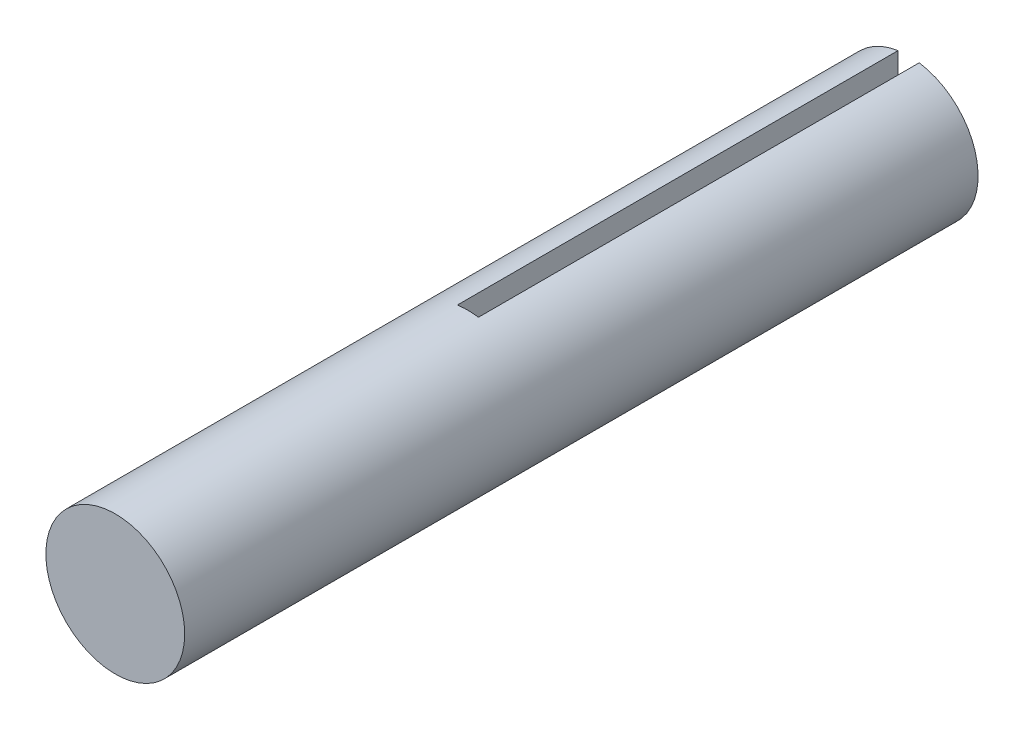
ISO-10303-21;
HEADER;
FILE_DESCRIPTION(('STEP AP214'),'2;1');
FILE_NAME('part.step','',(''),(''),'','','');
FILE_SCHEMA(('AUTOMOTIVE_DESIGN { 1 0 10303 214 1 1 1 1 }'));
ENDSEC;
DATA;
#1=APPLICATION_CONTEXT('core data for automotive mechanical design processes');
#2=APPLICATION_PROTOCOL_DEFINITION('international standard','automotive_design',2000,#1);
#3=PRODUCT_CONTEXT('',#1,'mechanical');
#4=PRODUCT('Part','Part','',(#3));
#5=PRODUCT_RELATED_PRODUCT_CATEGORY('part','',(#4));
#6=PRODUCT_DEFINITION_FORMATION('','',#4);
#7=PRODUCT_DEFINITION_CONTEXT('part definition',#1,'design');
#8=PRODUCT_DEFINITION('design','',#6,#7);
#9=PRODUCT_DEFINITION_SHAPE('','',#8);
#10=(LENGTH_UNIT() NAMED_UNIT(*) SI_UNIT(.MILLI.,.METRE.));
#11=(NAMED_UNIT(*) PLANE_ANGLE_UNIT() SI_UNIT($,.RADIAN.));
#12=(NAMED_UNIT(*) SI_UNIT($,.STERADIAN.) SOLID_ANGLE_UNIT());
#13=UNCERTAINTY_MEASURE_WITH_UNIT(LENGTH_MEASURE(1.E-05),#10,'distance_accuracy_value','');
#14=(GEOMETRIC_REPRESENTATION_CONTEXT(3) GLOBAL_UNCERTAINTY_ASSIGNED_CONTEXT((#13)) GLOBAL_UNIT_ASSIGNED_CONTEXT((#10,
#11,#12)) REPRESENTATION_CONTEXT('',''));
#15=CARTESIAN_POINT('',(0.,0.,0.));
#16=DIRECTION('',(0.,0.,1.));
#17=DIRECTION('',(1.,0.,0.));
#18=AXIS2_PLACEMENT_3D('',#15,#16,#17);
#19=CARTESIAN_POINT('',(0.,0.,0.));
#20=DIRECTION('',(0.,0.,1.));
#21=DIRECTION('',(1.,0.,0.));
#22=AXIS2_PLACEMENT_3D('',#19,#20,#21);
#23=PLANE('',#22);
#24=DIRECTION('',(0.,-1.,0.));
#25=VECTOR('',#24,1.);
#26=CARTESIAN_POINT('',(-0.2286,1.65217391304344,0.));
#27=LINE('',#26,#25);
#28=CARTESIAN_POINT('',(-0.2286,1.48247834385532,0.));
#29=VERTEX_POINT('',#28);
#30=CARTESIAN_POINT('',(-0.2286,0.970387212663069,0.));
#31=VERTEX_POINT('',#30);
#32=EDGE_CURVE('E92',#29,#31,#27,.T.);
#33=ORIENTED_EDGE('',*,*,#32,.T.);
#34=CARTESIAN_POINT('',(0.,0.,0.));
#35=DIRECTION('',(0.,0.,1.));
#36=DIRECTION('',(1.,0.,0.));
#37=AXIS2_PLACEMENT_3D('',#34,#35,#36);
#38=CIRCLE('',#37,0.99695);
#39=CARTESIAN_POINT('',(0.2286,0.970387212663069,0.));
#40=VERTEX_POINT('',#39);
#41=EDGE_CURVE('E93',#31,#40,#38,.T.);
#42=ORIENTED_EDGE('',*,*,#41,.T.);
#43=DIRECTION('',(0.,1.,0.));
#44=VECTOR('',#43,1.);
#45=CARTESIAN_POINT('',(0.2286,1.65217391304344,0.));
#46=LINE('',#45,#44);
#47=CARTESIAN_POINT('',(0.2286,1.48247834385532,0.));
#48=VERTEX_POINT('',#47);
#49=EDGE_CURVE('E47',#40,#48,#46,.T.);
#50=ORIENTED_EDGE('',*,*,#49,.T.);
#51=CARTESIAN_POINT('',(0.,0.,0.));
#52=DIRECTION('',(0.,0.,1.));
#53=DIRECTION('',(1.,0.,0.));
#54=AXIS2_PLACEMENT_3D('',#51,#52,#53);
#55=CIRCLE('',#54,1.5);
#56=EDGE_CURVE('E110',#29,#48,#55,.T.);
#57=ORIENTED_EDGE('',*,*,#56,.F.);
#58=EDGE_LOOP('',(#33,#42,#50,#57));
#59=FACE_BOUND('',#58,.T.);
#60=ADVANCED_FACE('F30',(#59),#23,.F.);
#61=CARTESIAN_POINT('',(0.,0.,9.525));
#62=DIRECTION('',(0.,0.,-1.));
#63=DIRECTION('',(-1.,0.,0.));
#64=AXIS2_PLACEMENT_3D('',#61,#62,#63);
#65=CYLINDRICAL_SURFACE('',#64,1.5);
#66=DIRECTION('',(0.,0.,-1.));
#67=VECTOR('',#66,1.);
#68=CARTESIAN_POINT('',(-0.2286,1.48247834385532,9.525));
#69=LINE('',#68,#67);
#70=CARTESIAN_POINT('',(-0.2286,1.48247834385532,9.525));
#71=VERTEX_POINT('',#70);
#72=EDGE_CURVE('E85',#29,#71,#69,.F.);
#73=ORIENTED_EDGE('',*,*,#72,.F.);
#74=ORIENTED_EDGE('',*,*,#56,.T.);
#75=DIRECTION('',(0.,0.,-1.));
#76=VECTOR('',#75,1.);
#77=CARTESIAN_POINT('',(0.2286,1.48247834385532,9.525));
#78=LINE('',#77,#76);
#79=CARTESIAN_POINT('',(0.2286,1.48247834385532,9.525));
#80=VERTEX_POINT('',#79);
#81=EDGE_CURVE('E87',#80,#48,#78,.T.);
#82=ORIENTED_EDGE('',*,*,#81,.F.);
#83=CARTESIAN_POINT('',(0.,0.,9.525));
#84=DIRECTION('',(0.,0.,1.));
#85=DIRECTION('',(1.,0.,0.));
#86=AXIS2_PLACEMENT_3D('',#83,#84,#85);
#87=CIRCLE('',#86,1.5);
#88=EDGE_CURVE('E55',#80,#71,#87,.T.);
#89=ORIENTED_EDGE('',*,*,#88,.T.);
#90=EDGE_LOOP('',(#73,#74,#82,#89));
#91=FACE_BOUND('',#90,.T.);
#92=CARTESIAN_POINT('',(0.,0.,17.145));
#93=DIRECTION('',(0.,0.,1.));
#94=DIRECTION('',(1.,0.,0.));
#95=AXIS2_PLACEMENT_3D('',#92,#93,#94);
#96=CIRCLE('',#95,1.5);
#97=CARTESIAN_POINT('',(1.5,0.,17.145));
#98=VERTEX_POINT('',#97);
#99=EDGE_CURVE('E88',#98,#98,#96,.T.);
#100=ORIENTED_EDGE('',*,*,#99,.F.);
#101=EDGE_LOOP('',(#100));
#102=FACE_BOUND('',#101,.T.);
#103=ADVANCED_FACE('F32',(#91,#102),#65,.T.);
#104=CARTESIAN_POINT('',(0.,0.,9.525));
#105=DIRECTION('',(0.,0.,-1.));
#106=DIRECTION('',(-1.,0.,0.));
#107=AXIS2_PLACEMENT_3D('',#104,#105,#106);
#108=CYLINDRICAL_SURFACE('',#107,0.99695);
#109=ORIENTED_EDGE('',*,*,#41,.F.);
#110=DIRECTION('',(0.,0.,-1.));
#111=VECTOR('',#110,1.);
#112=CARTESIAN_POINT('',(-0.2286,0.970387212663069,9.525));
#113=LINE('',#112,#111);
#114=CARTESIAN_POINT('',(-0.2286,0.970387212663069,9.525));
#115=VERTEX_POINT('',#114);
#116=EDGE_CURVE('E11',#31,#115,#113,.F.);
#117=ORIENTED_EDGE('',*,*,#116,.T.);
#118=CARTESIAN_POINT('',(0.,0.,9.525));
#119=DIRECTION('',(0.,0.,1.));
#120=DIRECTION('',(1.,0.,0.));
#121=AXIS2_PLACEMENT_3D('',#118,#119,#120);
#122=CIRCLE('',#121,0.99695);
#123=CARTESIAN_POINT('',(0.2286,0.970387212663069,9.525));
#124=VERTEX_POINT('',#123);
#125=EDGE_CURVE('E75',#115,#124,#122,.T.);
#126=ORIENTED_EDGE('',*,*,#125,.T.);
#127=DIRECTION('',(0.,0.,-1.));
#128=VECTOR('',#127,1.);
#129=CARTESIAN_POINT('',(0.2286,0.970387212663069,9.525));
#130=LINE('',#129,#128);
#131=EDGE_CURVE('E39',#124,#40,#130,.T.);
#132=ORIENTED_EDGE('',*,*,#131,.T.);
#133=EDGE_LOOP('',(#109,#117,#126,#132));
#134=FACE_BOUND('',#133,.T.);
#135=ADVANCED_FACE('F114',(#134),#108,.F.);
#136=CARTESIAN_POINT('',(0.2286,1.65217391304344,9.525));
#137=DIRECTION('',(-1.,0.,0.));
#138=DIRECTION('',(0.,-1.,0.));
#139=AXIS2_PLACEMENT_3D('',#136,#137,#138);
#140=PLANE('',#139);
#141=ORIENTED_EDGE('',*,*,#81,.T.);
#142=ORIENTED_EDGE('',*,*,#49,.F.);
#143=ORIENTED_EDGE('',*,*,#131,.F.);
#144=DIRECTION('',(0.,1.,0.));
#145=VECTOR('',#144,1.);
#146=CARTESIAN_POINT('',(0.2286,1.65217391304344,9.525));
#147=LINE('',#146,#145);
#148=EDGE_CURVE('E78',#124,#80,#147,.T.);
#149=ORIENTED_EDGE('',*,*,#148,.T.);
#150=EDGE_LOOP('',(#141,#142,#143,#149));
#151=FACE_BOUND('',#150,.T.);
#152=ADVANCED_FACE('F123',(#151),#140,.T.);
#153=CARTESIAN_POINT('',(-0.2286,1.65217391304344,9.525));
#154=DIRECTION('',(1.,0.,0.));
#155=DIRECTION('',(0.,1.,0.));
#156=AXIS2_PLACEMENT_3D('',#153,#154,#155);
#157=PLANE('',#156);
#158=ORIENTED_EDGE('',*,*,#72,.T.);
#159=DIRECTION('',(0.,-1.,0.));
#160=VECTOR('',#159,1.);
#161=CARTESIAN_POINT('',(-0.2286,1.65217391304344,9.525));
#162=LINE('',#161,#160);
#163=EDGE_CURVE('E72',#71,#115,#162,.T.);
#164=ORIENTED_EDGE('',*,*,#163,.T.);
#165=ORIENTED_EDGE('',*,*,#116,.F.);
#166=ORIENTED_EDGE('',*,*,#32,.F.);
#167=EDGE_LOOP('',(#158,#164,#165,#166));
#168=FACE_BOUND('',#167,.T.);
#169=ADVANCED_FACE('F90',(#168),#157,.T.);
#170=CARTESIAN_POINT('',(0.,0.,17.145));
#171=DIRECTION('',(0.,0.,1.));
#172=DIRECTION('',(1.,0.,0.));
#173=AXIS2_PLACEMENT_3D('',#170,#171,#172);
#174=PLANE('',#173);
#175=ORIENTED_EDGE('',*,*,#99,.T.);
#176=EDGE_LOOP('',(#175));
#177=FACE_BOUND('',#176,.T.);
#178=ADVANCED_FACE('F126',(#177),#174,.T.);
#179=CARTESIAN_POINT('',(0.,0.,9.525));
#180=DIRECTION('',(0.,0.,1.));
#181=DIRECTION('',(1.,0.,0.));
#182=AXIS2_PLACEMENT_3D('',#179,#180,#181);
#183=PLANE('',#182);
#184=ORIENTED_EDGE('',*,*,#163,.F.);
#185=ORIENTED_EDGE('',*,*,#88,.F.);
#186=ORIENTED_EDGE('',*,*,#148,.F.);
#187=ORIENTED_EDGE('',*,*,#125,.F.);
#188=EDGE_LOOP('',(#184,#185,#186,#187));
#189=FACE_BOUND('',#188,.T.);
#190=ADVANCED_FACE('F73',(#189),#183,.F.);
#191=CLOSED_SHELL('',(#60,#103,#135,#152,#169,#178,#190));
#192=MANIFOLD_SOLID_BREP('B2',#191);
#193=ADVANCED_BREP_SHAPE_REPRESENTATION('',(#18,#192),#14);
#194=SHAPE_DEFINITION_REPRESENTATION(#9,#193);
ENDSEC;
END-ISO-10303-21;
